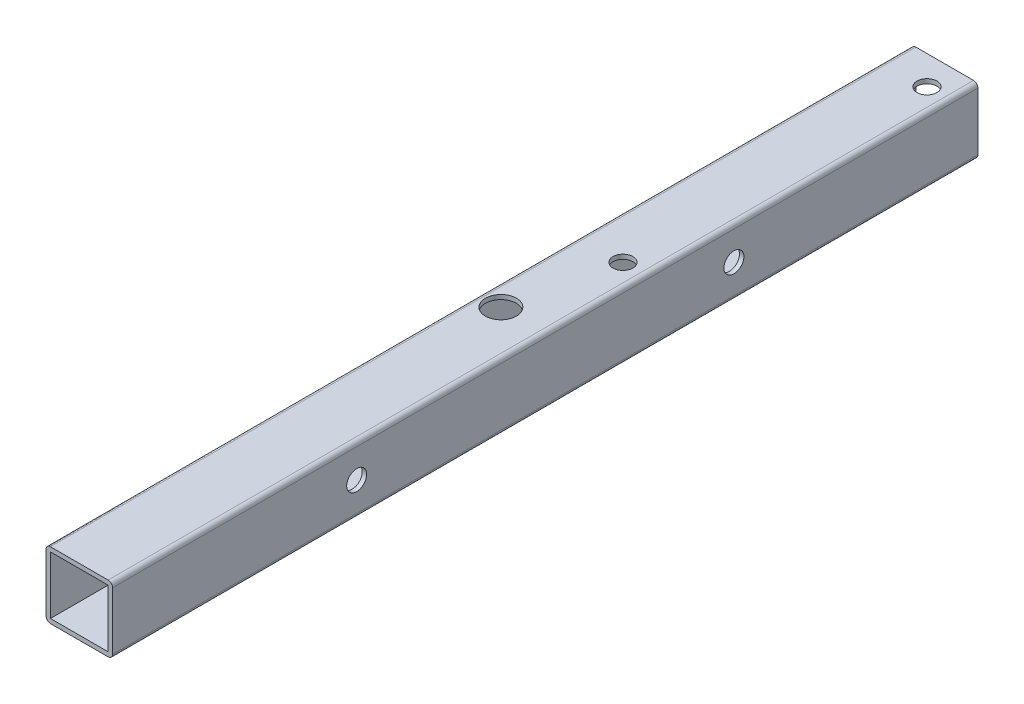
ISO-10303-21;
HEADER;
FILE_DESCRIPTION(('STEP AP214'),'2;1');
FILE_NAME('part.step','',(''),(''),'','','');
FILE_SCHEMA(('AUTOMOTIVE_DESIGN { 1 0 10303 214 1 1 1 1 }'));
ENDSEC;
DATA;
#1=APPLICATION_CONTEXT('core data for automotive mechanical design processes');
#2=APPLICATION_PROTOCOL_DEFINITION('international standard','automotive_design',2000,#1);
#3=PRODUCT_CONTEXT('',#1,'mechanical');
#4=PRODUCT('Part','Part','',(#3));
#5=PRODUCT_RELATED_PRODUCT_CATEGORY('part','',(#4));
#6=PRODUCT_DEFINITION_FORMATION('','',#4);
#7=PRODUCT_DEFINITION_CONTEXT('part definition',#1,'design');
#8=PRODUCT_DEFINITION('design','',#6,#7);
#9=PRODUCT_DEFINITION_SHAPE('','',#8);
#10=(LENGTH_UNIT() NAMED_UNIT(*) SI_UNIT(.MILLI.,.METRE.));
#11=(NAMED_UNIT(*) PLANE_ANGLE_UNIT() SI_UNIT($,.RADIAN.));
#12=(NAMED_UNIT(*) SI_UNIT($,.STERADIAN.) SOLID_ANGLE_UNIT());
#13=UNCERTAINTY_MEASURE_WITH_UNIT(LENGTH_MEASURE(1.E-05),#10,'distance_accuracy_value','');
#14=(GEOMETRIC_REPRESENTATION_CONTEXT(3) GLOBAL_UNCERTAINTY_ASSIGNED_CONTEXT((#13)) GLOBAL_UNIT_ASSIGNED_CONTEXT((#10,
#11,#12)) REPRESENTATION_CONTEXT('',''));
#15=CARTESIAN_POINT('',(0.,0.,0.));
#16=DIRECTION('',(0.,0.,1.));
#17=DIRECTION('',(1.,0.,0.));
#18=AXIS2_PLACEMENT_3D('',#15,#16,#17);
#19=CARTESIAN_POINT('',(-13.,-13.,0.));
#20=DIRECTION('',(0.,0.,-1.));
#21=DIRECTION('',(-1.,0.,0.));
#22=AXIS2_PLACEMENT_3D('',#19,#20,#21);
#23=PLANE('',#22);
#24=CARTESIAN_POINT('',(-13.,-13.,0.));
#25=DIRECTION('',(0.,0.,-1.));
#26=DIRECTION('',(-1.,0.,0.));
#27=AXIS2_PLACEMENT_3D('',#24,#25,#26);
#28=CIRCLE('',#27,2.);
#29=CARTESIAN_POINT('',(-13.,-15.,0.));
#30=VERTEX_POINT('',#29);
#31=CARTESIAN_POINT('',(-15.,-13.,0.));
#32=VERTEX_POINT('',#31);
#33=EDGE_CURVE('E127',#30,#32,#28,.T.);
#34=ORIENTED_EDGE('',*,*,#33,.T.);
#35=DIRECTION('',(0.,-1.,0.));
#36=VECTOR('',#35,1.);
#37=CARTESIAN_POINT('',(-15.,13.,0.));
#38=LINE('',#37,#36);
#39=CARTESIAN_POINT('',(-15.,13.,0.));
#40=VERTEX_POINT('',#39);
#41=EDGE_CURVE('E164',#40,#32,#38,.T.);
#42=ORIENTED_EDGE('',*,*,#41,.F.);
#43=CARTESIAN_POINT('',(-13.,13.,0.));
#44=DIRECTION('',(0.,0.,-1.));
#45=DIRECTION('',(-1.,0.,0.));
#46=AXIS2_PLACEMENT_3D('',#43,#44,#45);
#47=CIRCLE('',#46,2.);
#48=CARTESIAN_POINT('',(-13.,15.,0.));
#49=VERTEX_POINT('',#48);
#50=EDGE_CURVE('E167',#40,#49,#47,.T.);
#51=ORIENTED_EDGE('',*,*,#50,.T.);
#52=DIRECTION('',(1.,0.,0.));
#53=VECTOR('',#52,1.);
#54=CARTESIAN_POINT('',(-13.,15.,0.));
#55=LINE('',#54,#53);
#56=CARTESIAN_POINT('',(13.,15.,0.));
#57=VERTEX_POINT('',#56);
#58=EDGE_CURVE('E170',#49,#57,#55,.T.);
#59=ORIENTED_EDGE('',*,*,#58,.T.);
#60=CARTESIAN_POINT('',(13.,13.,0.));
#61=DIRECTION('',(0.,0.,1.));
#62=DIRECTION('',(1.,0.,0.));
#63=AXIS2_PLACEMENT_3D('',#60,#61,#62);
#64=CIRCLE('',#63,2.);
#65=CARTESIAN_POINT('',(15.,13.,0.));
#66=VERTEX_POINT('',#65);
#67=EDGE_CURVE('E173',#66,#57,#64,.T.);
#68=ORIENTED_EDGE('',*,*,#67,.F.);
#69=DIRECTION('',(0.,1.,0.));
#70=VECTOR('',#69,1.);
#71=CARTESIAN_POINT('',(15.,-13.,0.));
#72=LINE('',#71,#70);
#73=CARTESIAN_POINT('',(15.,-13.,0.));
#74=VERTEX_POINT('',#73);
#75=EDGE_CURVE('E176',#74,#66,#72,.T.);
#76=ORIENTED_EDGE('',*,*,#75,.F.);
#77=CARTESIAN_POINT('',(13.,-13.,0.));
#78=DIRECTION('',(0.,0.,-1.));
#79=DIRECTION('',(-1.,0.,0.));
#80=AXIS2_PLACEMENT_3D('',#77,#78,#79);
#81=CIRCLE('',#80,2.);
#82=CARTESIAN_POINT('',(13.,-15.,0.));
#83=VERTEX_POINT('',#82);
#84=EDGE_CURVE('E178',#74,#83,#81,.T.);
#85=ORIENTED_EDGE('',*,*,#84,.T.);
#86=DIRECTION('',(-1.,0.,0.));
#87=VECTOR('',#86,1.);
#88=CARTESIAN_POINT('',(13.,-15.,0.));
#89=LINE('',#88,#87);
#90=EDGE_CURVE('E181',#83,#30,#89,.T.);
#91=ORIENTED_EDGE('',*,*,#90,.T.);
#92=EDGE_LOOP('',(#34,#42,#51,#59,#68,#76,#85,#91));
#93=FACE_BOUND('',#92,.T.);
#94=DIRECTION('',(1.,0.,0.));
#95=VECTOR('',#94,1.);
#96=CARTESIAN_POINT('',(-13.,13.,0.));
#97=LINE('',#96,#95);
#98=CARTESIAN_POINT('',(-13.,13.,0.));
#99=VERTEX_POINT('',#98);
#100=CARTESIAN_POINT('',(13.,13.,0.));
#101=VERTEX_POINT('',#100);
#102=EDGE_CURVE('E139',#99,#101,#97,.T.);
#103=ORIENTED_EDGE('',*,*,#102,.F.);
#104=DIRECTION('',(0.,-1.,0.));
#105=VECTOR('',#104,1.);
#106=CARTESIAN_POINT('',(-13.,-13.,0.));
#107=LINE('',#106,#105);
#108=CARTESIAN_POINT('',(-13.,-13.,0.));
#109=VERTEX_POINT('',#108);
#110=EDGE_CURVE('E55',#99,#109,#107,.T.);
#111=ORIENTED_EDGE('',*,*,#110,.T.);
#112=DIRECTION('',(-1.,0.,0.));
#113=VECTOR('',#112,1.);
#114=CARTESIAN_POINT('',(-13.,-13.,0.));
#115=LINE('',#114,#113);
#116=CARTESIAN_POINT('',(13.,-13.,0.));
#117=VERTEX_POINT('',#116);
#118=EDGE_CURVE('E131',#117,#109,#115,.T.);
#119=ORIENTED_EDGE('',*,*,#118,.F.);
#120=DIRECTION('',(0.,1.,0.));
#121=VECTOR('',#120,1.);
#122=CARTESIAN_POINT('',(13.,-13.,0.));
#123=LINE('',#122,#121);
#124=EDGE_CURVE('E136',#117,#101,#123,.T.);
#125=ORIENTED_EDGE('',*,*,#124,.T.);
#126=EDGE_LOOP('',(#103,#111,#119,#125));
#127=FACE_BOUND('',#126,.T.);
#128=ADVANCED_FACE('F30',(#93,#127),#23,.T.);
#129=CARTESIAN_POINT('',(-13.,-13.,390.));
#130=DIRECTION('',(0.,0.,-1.));
#131=DIRECTION('',(-1.,0.,0.));
#132=AXIS2_PLACEMENT_3D('',#129,#130,#131);
#133=CYLINDRICAL_SURFACE('',#132,2.);
#134=ORIENTED_EDGE('',*,*,#33,.F.);
#135=DIRECTION('',(0.,0.,-1.));
#136=VECTOR('',#135,1.);
#137=CARTESIAN_POINT('',(-13.,-15.,390.));
#138=LINE('',#137,#136);
#139=CARTESIAN_POINT('',(-13.,-15.,390.));
#140=VERTEX_POINT('',#139);
#141=EDGE_CURVE('E11',#140,#30,#138,.T.);
#142=ORIENTED_EDGE('',*,*,#141,.F.);
#143=CARTESIAN_POINT('',(-13.,-13.,390.));
#144=DIRECTION('',(0.,0.,-1.));
#145=DIRECTION('',(-1.,0.,0.));
#146=AXIS2_PLACEMENT_3D('',#143,#144,#145);
#147=CIRCLE('',#146,2.);
#148=CARTESIAN_POINT('',(-15.,-13.,390.));
#149=VERTEX_POINT('',#148);
#150=EDGE_CURVE('E184',#140,#149,#147,.T.);
#151=ORIENTED_EDGE('',*,*,#150,.T.);
#152=DIRECTION('',(0.,0.,-1.));
#153=VECTOR('',#152,1.);
#154=CARTESIAN_POINT('',(-15.,-13.,390.));
#155=LINE('',#154,#153);
#156=EDGE_CURVE('E204',#149,#32,#155,.T.);
#157=ORIENTED_EDGE('',*,*,#156,.T.);
#158=EDGE_LOOP('',(#134,#142,#151,#157));
#159=FACE_BOUND('',#158,.T.);
#160=ADVANCED_FACE('F32',(#159),#133,.T.);
#161=CARTESIAN_POINT('',(13.,-15.,390.));
#162=DIRECTION('',(0.,-1.,0.));
#163=DIRECTION('',(1.,0.,0.));
#164=AXIS2_PLACEMENT_3D('',#161,#162,#163);
#165=PLANE('',#164);
#166=CARTESIAN_POINT('',(5.,-15.,13.));
#167=DIRECTION('',(0.,-1.,0.));
#168=DIRECTION('',(1.,0.,0.));
#169=AXIS2_PLACEMENT_3D('',#166,#167,#168);
#170=CIRCLE('',#169,7.);
#171=CARTESIAN_POINT('',(12.,-15.,13.));
#172=VERTEX_POINT('',#171);
#173=EDGE_CURVE('E497',#172,#172,#170,.T.);
#174=ORIENTED_EDGE('',*,*,#173,.F.);
#175=EDGE_LOOP('',(#174));
#176=FACE_BOUND('',#175,.T.);
#177=CARTESIAN_POINT('',(5.00000000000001,-15.,150.));
#178=DIRECTION('',(0.,-1.,0.));
#179=DIRECTION('',(1.,0.,0.));
#180=AXIS2_PLACEMENT_3D('',#177,#178,#179);
#181=CIRCLE('',#180,7.);
#182=CARTESIAN_POINT('',(12.,-15.,150.));
#183=VERTEX_POINT('',#182);
#184=EDGE_CURVE('E500',#183,#183,#181,.T.);
#185=ORIENTED_EDGE('',*,*,#184,.F.);
#186=EDGE_LOOP('',(#185));
#187=FACE_BOUND('',#186,.T.);
#188=CARTESIAN_POINT('',(-5.,-15.,195.));
#189=DIRECTION('',(0.,1.,0.));
#190=DIRECTION('',(0.,0.,1.));
#191=AXIS2_PLACEMENT_3D('',#188,#189,#190);
#192=CIRCLE('',#191,7.);
#193=CARTESIAN_POINT('',(-5.,-15.,202.));
#194=VERTEX_POINT('',#193);
#195=EDGE_CURVE('E227',#194,#194,#192,.T.);
#196=ORIENTED_EDGE('',*,*,#195,.T.);
#197=EDGE_LOOP('',(#196));
#198=FACE_BOUND('',#197,.T.);
#199=ORIENTED_EDGE('',*,*,#90,.F.);
#200=DIRECTION('',(0.,0.,-1.));
#201=VECTOR('',#200,1.);
#202=CARTESIAN_POINT('',(13.,-15.,390.));
#203=LINE('',#202,#201);
#204=CARTESIAN_POINT('',(13.,-15.,390.));
#205=VERTEX_POINT('',#204);
#206=EDGE_CURVE('E39',#205,#83,#203,.T.);
#207=ORIENTED_EDGE('',*,*,#206,.F.);
#208=DIRECTION('',(-1.,0.,0.));
#209=VECTOR('',#208,1.);
#210=CARTESIAN_POINT('',(13.,-15.,390.));
#211=LINE('',#210,#209);
#212=EDGE_CURVE('E202',#205,#140,#211,.T.);
#213=ORIENTED_EDGE('',*,*,#212,.T.);
#214=ORIENTED_EDGE('',*,*,#141,.T.);
#215=EDGE_LOOP('',(#199,#207,#213,#214));
#216=FACE_BOUND('',#215,.T.);
#217=ADVANCED_FACE('F306',(#176,#187,#198,#216),#165,.T.);
#218=CARTESIAN_POINT('',(13.,-13.,390.));
#219=DIRECTION('',(0.,0.,-1.));
#220=DIRECTION('',(-1.,0.,0.));
#221=AXIS2_PLACEMENT_3D('',#218,#219,#220);
#222=CYLINDRICAL_SURFACE('',#221,2.);
#223=ORIENTED_EDGE('',*,*,#84,.F.);
#224=DIRECTION('',(0.,0.,-1.));
#225=VECTOR('',#224,1.);
#226=CARTESIAN_POINT('',(15.,-13.,390.));
#227=LINE('',#226,#225);
#228=CARTESIAN_POINT('',(15.,-13.,390.));
#229=VERTEX_POINT('',#228);
#230=EDGE_CURVE('E207',#229,#74,#227,.T.);
#231=ORIENTED_EDGE('',*,*,#230,.F.);
#232=CARTESIAN_POINT('',(13.,-13.,390.));
#233=DIRECTION('',(0.,0.,-1.));
#234=DIRECTION('',(-1.,0.,0.));
#235=AXIS2_PLACEMENT_3D('',#232,#233,#234);
#236=CIRCLE('',#235,2.);
#237=EDGE_CURVE('E199',#229,#205,#236,.T.);
#238=ORIENTED_EDGE('',*,*,#237,.T.);
#239=ORIENTED_EDGE('',*,*,#206,.T.);
#240=EDGE_LOOP('',(#223,#231,#238,#239));
#241=FACE_BOUND('',#240,.T.);
#242=ADVANCED_FACE('F303',(#241),#222,.T.);
#243=CARTESIAN_POINT('',(15.,-13.,390.));
#244=DIRECTION('',(-1.,0.,0.));
#245=DIRECTION('',(0.,0.,1.));
#246=AXIS2_PLACEMENT_3D('',#243,#244,#245);
#247=PLANE('',#246);
#248=CARTESIAN_POINT('',(15.,0.,280.));
#249=DIRECTION('',(-1.,0.,0.));
#250=DIRECTION('',(0.,-1.,0.));
#251=AXIS2_PLACEMENT_3D('',#248,#249,#250);
#252=CIRCLE('',#251,4.50000000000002);
#253=CARTESIAN_POINT('',(15.,-4.50000000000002,280.));
#254=VERTEX_POINT('',#253);
#255=EDGE_CURVE('E235',#254,#254,#252,.T.);
#256=ORIENTED_EDGE('',*,*,#255,.T.);
#257=EDGE_LOOP('',(#256));
#258=FACE_BOUND('',#257,.T.);
#259=CARTESIAN_POINT('',(15.,0.,110.));
#260=DIRECTION('',(-1.,0.,0.));
#261=DIRECTION('',(0.,-1.,0.));
#262=AXIS2_PLACEMENT_3D('',#259,#260,#261);
#263=CIRCLE('',#262,4.5);
#264=CARTESIAN_POINT('',(15.,-4.5,110.));
#265=VERTEX_POINT('',#264);
#266=EDGE_CURVE('E231',#265,#265,#263,.T.);
#267=ORIENTED_EDGE('',*,*,#266,.T.);
#268=EDGE_LOOP('',(#267));
#269=FACE_BOUND('',#268,.T.);
#270=ORIENTED_EDGE('',*,*,#75,.T.);
#271=DIRECTION('',(0.,0.,-1.));
#272=VECTOR('',#271,1.);
#273=CARTESIAN_POINT('',(15.,13.,390.));
#274=LINE('',#273,#272);
#275=CARTESIAN_POINT('',(15.,13.,390.));
#276=VERTEX_POINT('',#275);
#277=EDGE_CURVE('E209',#276,#66,#274,.T.);
#278=ORIENTED_EDGE('',*,*,#277,.F.);
#279=DIRECTION('',(0.,1.,0.));
#280=VECTOR('',#279,1.);
#281=CARTESIAN_POINT('',(15.,-13.,390.));
#282=LINE('',#281,#280);
#283=EDGE_CURVE('E197',#229,#276,#282,.T.);
#284=ORIENTED_EDGE('',*,*,#283,.F.);
#285=ORIENTED_EDGE('',*,*,#230,.T.);
#286=EDGE_LOOP('',(#270,#278,#284,#285));
#287=FACE_BOUND('',#286,.T.);
#288=ADVANCED_FACE('F335',(#258,#269,#287),#247,.F.);
#289=CARTESIAN_POINT('',(13.,13.,390.));
#290=DIRECTION('',(0.,0.,-1.));
#291=DIRECTION('',(-1.,0.,0.));
#292=AXIS2_PLACEMENT_3D('',#289,#290,#291);
#293=CYLINDRICAL_SURFACE('',#292,2.);
#294=ORIENTED_EDGE('',*,*,#67,.T.);
#295=DIRECTION('',(0.,0.,-1.));
#296=VECTOR('',#295,1.);
#297=CARTESIAN_POINT('',(13.,15.,390.));
#298=LINE('',#297,#296);
#299=CARTESIAN_POINT('',(13.,15.,390.));
#300=VERTEX_POINT('',#299);
#301=EDGE_CURVE('E212',#300,#57,#298,.T.);
#302=ORIENTED_EDGE('',*,*,#301,.F.);
#303=CARTESIAN_POINT('',(13.,13.,390.));
#304=DIRECTION('',(0.,0.,1.));
#305=DIRECTION('',(1.,0.,0.));
#306=AXIS2_PLACEMENT_3D('',#303,#304,#305);
#307=CIRCLE('',#306,2.);
#308=EDGE_CURVE('E195',#276,#300,#307,.T.);
#309=ORIENTED_EDGE('',*,*,#308,.F.);
#310=ORIENTED_EDGE('',*,*,#277,.T.);
#311=EDGE_LOOP('',(#294,#302,#309,#310));
#312=FACE_BOUND('',#311,.T.);
#313=ADVANCED_FACE('F273',(#312),#293,.T.);
#314=CARTESIAN_POINT('',(-13.,15.,390.));
#315=DIRECTION('',(0.,1.,0.));
#316=DIRECTION('',(-1.,0.,0.));
#317=AXIS2_PLACEMENT_3D('',#314,#315,#316);
#318=PLANE('',#317);
#319=CARTESIAN_POINT('',(-5.,15.,195.));
#320=DIRECTION('',(0.,1.,0.));
#321=DIRECTION('',(0.,0.,1.));
#322=AXIS2_PLACEMENT_3D('',#319,#320,#321);
#323=CIRCLE('',#322,7.);
#324=CARTESIAN_POINT('',(-5.,15.,202.));
#325=VERTEX_POINT('',#324);
#326=EDGE_CURVE('E257',#325,#325,#323,.T.);
#327=ORIENTED_EDGE('',*,*,#326,.F.);
#328=EDGE_LOOP('',(#327));
#329=FACE_BOUND('',#328,.T.);
#330=CARTESIAN_POINT('',(5.00000000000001,15.,150.));
#331=DIRECTION('',(0.,1.,0.));
#332=DIRECTION('',(0.,0.,1.));
#333=AXIS2_PLACEMENT_3D('',#330,#331,#332);
#334=CIRCLE('',#333,4.5);
#335=CARTESIAN_POINT('',(5.00000000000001,15.,154.5));
#336=VERTEX_POINT('',#335);
#337=EDGE_CURVE('E222',#336,#336,#334,.T.);
#338=ORIENTED_EDGE('',*,*,#337,.F.);
#339=EDGE_LOOP('',(#338));
#340=FACE_BOUND('',#339,.T.);
#341=CARTESIAN_POINT('',(5.00000000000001,15.,13.));
#342=DIRECTION('',(0.,1.,0.));
#343=DIRECTION('',(0.,0.,1.));
#344=AXIS2_PLACEMENT_3D('',#341,#342,#343);
#345=CIRCLE('',#344,4.5);
#346=CARTESIAN_POINT('',(5.00000000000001,15.,17.5));
#347=VERTEX_POINT('',#346);
#348=EDGE_CURVE('E143',#347,#347,#345,.T.);
#349=ORIENTED_EDGE('',*,*,#348,.F.);
#350=EDGE_LOOP('',(#349));
#351=FACE_BOUND('',#350,.T.);
#352=ORIENTED_EDGE('',*,*,#58,.F.);
#353=DIRECTION('',(0.,0.,-1.));
#354=VECTOR('',#353,1.);
#355=CARTESIAN_POINT('',(-13.,15.,390.));
#356=LINE('',#355,#354);
#357=CARTESIAN_POINT('',(-13.,15.,390.));
#358=VERTEX_POINT('',#357);
#359=EDGE_CURVE('E214',#358,#49,#356,.T.);
#360=ORIENTED_EDGE('',*,*,#359,.F.);
#361=DIRECTION('',(1.,0.,0.));
#362=VECTOR('',#361,1.);
#363=CARTESIAN_POINT('',(-13.,15.,390.));
#364=LINE('',#363,#362);
#365=EDGE_CURVE('E192',#358,#300,#364,.T.);
#366=ORIENTED_EDGE('',*,*,#365,.T.);
#367=ORIENTED_EDGE('',*,*,#301,.T.);
#368=EDGE_LOOP('',(#352,#360,#366,#367));
#369=FACE_BOUND('',#368,.T.);
#370=ADVANCED_FACE('F269',(#329,#340,#351,#369),#318,.T.);
#371=CARTESIAN_POINT('',(-13.,13.,390.));
#372=DIRECTION('',(0.,0.,-1.));
#373=DIRECTION('',(-1.,0.,0.));
#374=AXIS2_PLACEMENT_3D('',#371,#372,#373);
#375=CYLINDRICAL_SURFACE('',#374,2.);
#376=ORIENTED_EDGE('',*,*,#50,.F.);
#377=DIRECTION('',(0.,0.,-1.));
#378=VECTOR('',#377,1.);
#379=CARTESIAN_POINT('',(-15.,13.,390.));
#380=LINE('',#379,#378);
#381=CARTESIAN_POINT('',(-15.,13.,390.));
#382=VERTEX_POINT('',#381);
#383=EDGE_CURVE('E216',#382,#40,#380,.T.);
#384=ORIENTED_EDGE('',*,*,#383,.F.);
#385=CARTESIAN_POINT('',(-13.,13.,390.));
#386=DIRECTION('',(0.,0.,-1.));
#387=DIRECTION('',(-1.,0.,0.));
#388=AXIS2_PLACEMENT_3D('',#385,#386,#387);
#389=CIRCLE('',#388,2.);
#390=EDGE_CURVE('E189',#382,#358,#389,.T.);
#391=ORIENTED_EDGE('',*,*,#390,.T.);
#392=ORIENTED_EDGE('',*,*,#359,.T.);
#393=EDGE_LOOP('',(#376,#384,#391,#392));
#394=FACE_BOUND('',#393,.T.);
#395=ADVANCED_FACE('F272',(#394),#375,.T.);
#396=CARTESIAN_POINT('',(-15.,13.,390.));
#397=DIRECTION('',(1.,0.,0.));
#398=DIRECTION('',(0.,1.,0.));
#399=AXIS2_PLACEMENT_3D('',#396,#397,#398);
#400=PLANE('',#399);
#401=CARTESIAN_POINT('',(-15.,0.,280.));
#402=DIRECTION('',(-1.,0.,0.));
#403=DIRECTION('',(0.,-1.,0.));
#404=AXIS2_PLACEMENT_3D('',#401,#402,#403);
#405=CIRCLE('',#404,4.50000000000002);
#406=CARTESIAN_POINT('',(-15.,-4.50000000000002,280.));
#407=VERTEX_POINT('',#406);
#408=EDGE_CURVE('E242',#407,#407,#405,.T.);
#409=ORIENTED_EDGE('',*,*,#408,.F.);
#410=EDGE_LOOP('',(#409));
#411=FACE_BOUND('',#410,.T.);
#412=CARTESIAN_POINT('',(-15.,0.,110.));
#413=DIRECTION('',(-1.,0.,0.));
#414=DIRECTION('',(0.,-1.,0.));
#415=AXIS2_PLACEMENT_3D('',#412,#413,#414);
#416=CIRCLE('',#415,4.5);
#417=CARTESIAN_POINT('',(-15.,-4.50000000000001,110.));
#418=VERTEX_POINT('',#417);
#419=EDGE_CURVE('E239',#418,#418,#416,.T.);
#420=ORIENTED_EDGE('',*,*,#419,.F.);
#421=EDGE_LOOP('',(#420));
#422=FACE_BOUND('',#421,.T.);
#423=ORIENTED_EDGE('',*,*,#41,.T.);
#424=ORIENTED_EDGE('',*,*,#156,.F.);
#425=DIRECTION('',(0.,-1.,0.));
#426=VECTOR('',#425,1.);
#427=CARTESIAN_POINT('',(-15.,13.,390.));
#428=LINE('',#427,#426);
#429=EDGE_CURVE('E187',#382,#149,#428,.T.);
#430=ORIENTED_EDGE('',*,*,#429,.F.);
#431=ORIENTED_EDGE('',*,*,#383,.T.);
#432=EDGE_LOOP('',(#423,#424,#430,#431));
#433=FACE_BOUND('',#432,.T.);
#434=ADVANCED_FACE('F310',(#411,#422,#433),#400,.F.);
#435=CARTESIAN_POINT('',(-13.,-13.,390.));
#436=DIRECTION('',(0.,0.,-1.));
#437=DIRECTION('',(-1.,0.,0.));
#438=AXIS2_PLACEMENT_3D('',#435,#436,#437);
#439=PLANE('',#438);
#440=DIRECTION('',(0.,1.,0.));
#441=VECTOR('',#440,1.);
#442=CARTESIAN_POINT('',(13.,-13.,390.));
#443=LINE('',#442,#441);
#444=CARTESIAN_POINT('',(13.,-13.,390.));
#445=VERTEX_POINT('',#444);
#446=CARTESIAN_POINT('',(13.,13.,390.));
#447=VERTEX_POINT('',#446);
#448=EDGE_CURVE('E153',#445,#447,#443,.T.);
#449=ORIENTED_EDGE('',*,*,#448,.F.);
#450=DIRECTION('',(-1.,0.,0.));
#451=VECTOR('',#450,1.);
#452=CARTESIAN_POINT('',(-13.,-13.,390.));
#453=LINE('',#452,#451);
#454=CARTESIAN_POINT('',(-13.,-13.,390.));
#455=VERTEX_POINT('',#454);
#456=EDGE_CURVE('E151',#445,#455,#453,.T.);
#457=ORIENTED_EDGE('',*,*,#456,.T.);
#458=DIRECTION('',(0.,-1.,0.));
#459=VECTOR('',#458,1.);
#460=CARTESIAN_POINT('',(-13.,-13.,390.));
#461=LINE('',#460,#459);
#462=CARTESIAN_POINT('',(-13.,13.,390.));
#463=VERTEX_POINT('',#462);
#464=EDGE_CURVE('E123',#463,#455,#461,.T.);
#465=ORIENTED_EDGE('',*,*,#464,.F.);
#466=DIRECTION('',(1.,0.,0.));
#467=VECTOR('',#466,1.);
#468=CARTESIAN_POINT('',(-13.,13.,390.));
#469=LINE('',#468,#467);
#470=EDGE_CURVE('E155',#463,#447,#469,.T.);
#471=ORIENTED_EDGE('',*,*,#470,.T.);
#472=EDGE_LOOP('',(#449,#457,#465,#471));
#473=FACE_BOUND('',#472,.T.);
#474=ORIENTED_EDGE('',*,*,#150,.F.);
#475=ORIENTED_EDGE('',*,*,#212,.F.);
#476=ORIENTED_EDGE('',*,*,#237,.F.);
#477=ORIENTED_EDGE('',*,*,#283,.T.);
#478=ORIENTED_EDGE('',*,*,#308,.T.);
#479=ORIENTED_EDGE('',*,*,#365,.F.);
#480=ORIENTED_EDGE('',*,*,#390,.F.);
#481=ORIENTED_EDGE('',*,*,#429,.T.);
#482=EDGE_LOOP('',(#474,#475,#476,#477,#478,#479,#480,#481));
#483=FACE_BOUND('',#482,.T.);
#484=ADVANCED_FACE('F291',(#473,#483),#439,.F.);
#485=CARTESIAN_POINT('',(-13.,-13.,390.));
#486=DIRECTION('',(1.,0.,0.));
#487=DIRECTION('',(0.,1.,0.));
#488=AXIS2_PLACEMENT_3D('',#485,#486,#487);
#489=PLANE('',#488);
#490=CARTESIAN_POINT('',(-13.,0.,280.));
#491=DIRECTION('',(1.,0.,0.));
#492=DIRECTION('',(0.,1.,0.));
#493=AXIS2_PLACEMENT_3D('',#490,#491,#492);
#494=CIRCLE('',#493,4.50000000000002);
#495=CARTESIAN_POINT('',(-13.,-4.50000000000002,280.));
#496=VERTEX_POINT('',#495);
#497=EDGE_CURVE('E234',#496,#496,#494,.T.);
#498=ORIENTED_EDGE('',*,*,#497,.F.);
#499=EDGE_LOOP('',(#498));
#500=FACE_BOUND('',#499,.T.);
#501=CARTESIAN_POINT('',(-13.,0.,110.));
#502=DIRECTION('',(1.,0.,0.));
#503=DIRECTION('',(0.,1.,0.));
#504=AXIS2_PLACEMENT_3D('',#501,#502,#503);
#505=CIRCLE('',#504,4.5);
#506=CARTESIAN_POINT('',(-13.,-4.50000000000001,110.));
#507=VERTEX_POINT('',#506);
#508=EDGE_CURVE('E230',#507,#507,#505,.T.);
#509=ORIENTED_EDGE('',*,*,#508,.F.);
#510=EDGE_LOOP('',(#509));
#511=FACE_BOUND('',#510,.T.);
#512=ORIENTED_EDGE('',*,*,#110,.F.);
#513=DIRECTION('',(0.,0.,-1.));
#514=VECTOR('',#513,1.);
#515=CARTESIAN_POINT('',(-13.,13.,390.));
#516=LINE('',#515,#514);
#517=EDGE_CURVE('E158',#463,#99,#516,.T.);
#518=ORIENTED_EDGE('',*,*,#517,.F.);
#519=ORIENTED_EDGE('',*,*,#464,.T.);
#520=DIRECTION('',(0.,0.,-1.));
#521=VECTOR('',#520,1.);
#522=CARTESIAN_POINT('',(-13.,-13.,390.));
#523=LINE('',#522,#521);
#524=EDGE_CURVE('E119',#455,#109,#523,.T.);
#525=ORIENTED_EDGE('',*,*,#524,.T.);
#526=EDGE_LOOP('',(#512,#518,#519,#525));
#527=FACE_BOUND('',#526,.T.);
#528=ADVANCED_FACE('F121',(#500,#511,#527),#489,.T.);
#529=CARTESIAN_POINT('',(-13.,-13.,390.));
#530=DIRECTION('',(0.,-1.,0.));
#531=DIRECTION('',(1.,0.,0.));
#532=AXIS2_PLACEMENT_3D('',#529,#530,#531);
#533=PLANE('',#532);
#534=CARTESIAN_POINT('',(5.,-13.,13.));
#535=DIRECTION('',(0.,-1.,0.));
#536=DIRECTION('',(1.,0.,0.));
#537=AXIS2_PLACEMENT_3D('',#534,#535,#536);
#538=CIRCLE('',#537,7.);
#539=CARTESIAN_POINT('',(12.,-13.,13.));
#540=VERTEX_POINT('',#539);
#541=EDGE_CURVE('E34',#540,#540,#538,.T.);
#542=ORIENTED_EDGE('',*,*,#541,.T.);
#543=EDGE_LOOP('',(#542));
#544=FACE_BOUND('',#543,.T.);
#545=CARTESIAN_POINT('',(5.,-13.,150.));
#546=DIRECTION('',(0.,-1.,0.));
#547=DIRECTION('',(1.,0.,0.));
#548=AXIS2_PLACEMENT_3D('',#545,#546,#547);
#549=CIRCLE('',#548,7.);
#550=CARTESIAN_POINT('',(12.,-13.,150.));
#551=VERTEX_POINT('',#550);
#552=EDGE_CURVE('E247',#551,#551,#549,.T.);
#553=ORIENTED_EDGE('',*,*,#552,.T.);
#554=EDGE_LOOP('',(#553));
#555=FACE_BOUND('',#554,.T.);
#556=CARTESIAN_POINT('',(-5.,-13.,195.));
#557=DIRECTION('',(0.,-1.,0.));
#558=DIRECTION('',(1.,0.,0.));
#559=AXIS2_PLACEMENT_3D('',#556,#557,#558);
#560=CIRCLE('',#559,7.);
#561=CARTESIAN_POINT('',(2.,-13.,195.));
#562=VERTEX_POINT('',#561);
#563=EDGE_CURVE('E226',#562,#562,#560,.T.);
#564=ORIENTED_EDGE('',*,*,#563,.T.);
#565=EDGE_LOOP('',(#564));
#566=FACE_BOUND('',#565,.T.);
#567=ORIENTED_EDGE('',*,*,#118,.T.);
#568=ORIENTED_EDGE('',*,*,#524,.F.);
#569=ORIENTED_EDGE('',*,*,#456,.F.);
#570=DIRECTION('',(0.,0.,-1.));
#571=VECTOR('',#570,1.);
#572=CARTESIAN_POINT('',(13.,-13.,390.));
#573=LINE('',#572,#571);
#574=EDGE_CURVE('E128',#445,#117,#573,.T.);
#575=ORIENTED_EDGE('',*,*,#574,.T.);
#576=EDGE_LOOP('',(#567,#568,#569,#575));
#577=FACE_BOUND('',#576,.T.);
#578=ADVANCED_FACE('F132',(#544,#555,#566,#577),#533,.F.);
#579=CARTESIAN_POINT('',(13.,-13.,390.));
#580=DIRECTION('',(-1.,0.,0.));
#581=DIRECTION('',(0.,0.,1.));
#582=AXIS2_PLACEMENT_3D('',#579,#580,#581);
#583=PLANE('',#582);
#584=CARTESIAN_POINT('',(13.,0.,280.));
#585=DIRECTION('',(-1.,0.,0.));
#586=DIRECTION('',(0.,0.,1.));
#587=AXIS2_PLACEMENT_3D('',#584,#585,#586);
#588=CIRCLE('',#587,4.50000000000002);
#589=CARTESIAN_POINT('',(13.,-4.50000000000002,280.));
#590=VERTEX_POINT('',#589);
#591=EDGE_CURVE('E232',#590,#590,#588,.T.);
#592=ORIENTED_EDGE('',*,*,#591,.F.);
#593=EDGE_LOOP('',(#592));
#594=FACE_BOUND('',#593,.T.);
#595=CARTESIAN_POINT('',(13.,0.,110.));
#596=DIRECTION('',(-1.,0.,0.));
#597=DIRECTION('',(0.,0.,1.));
#598=AXIS2_PLACEMENT_3D('',#595,#596,#597);
#599=CIRCLE('',#598,4.5);
#600=CARTESIAN_POINT('',(13.,-4.5,110.));
#601=VERTEX_POINT('',#600);
#602=EDGE_CURVE('E228',#601,#601,#599,.T.);
#603=ORIENTED_EDGE('',*,*,#602,.F.);
#604=EDGE_LOOP('',(#603));
#605=FACE_BOUND('',#604,.T.);
#606=ORIENTED_EDGE('',*,*,#124,.F.);
#607=ORIENTED_EDGE('',*,*,#574,.F.);
#608=ORIENTED_EDGE('',*,*,#448,.T.);
#609=DIRECTION('',(0.,0.,-1.));
#610=VECTOR('',#609,1.);
#611=CARTESIAN_POINT('',(13.,13.,390.));
#612=LINE('',#611,#610);
#613=EDGE_CURVE('E47',#447,#101,#612,.T.);
#614=ORIENTED_EDGE('',*,*,#613,.T.);
#615=EDGE_LOOP('',(#606,#607,#608,#614));
#616=FACE_BOUND('',#615,.T.);
#617=ADVANCED_FACE('F375',(#594,#605,#616),#583,.T.);
#618=CARTESIAN_POINT('',(-13.,13.,390.));
#619=DIRECTION('',(0.,1.,0.));
#620=DIRECTION('',(-1.,0.,0.));
#621=AXIS2_PLACEMENT_3D('',#618,#619,#620);
#622=PLANE('',#621);
#623=CARTESIAN_POINT('',(-5.,13.,195.));
#624=DIRECTION('',(0.,1.,0.));
#625=DIRECTION('',(-1.,0.,0.));
#626=AXIS2_PLACEMENT_3D('',#623,#624,#625);
#627=CIRCLE('',#626,7.);
#628=CARTESIAN_POINT('',(-12.,13.,195.));
#629=VERTEX_POINT('',#628);
#630=EDGE_CURVE('E223',#629,#629,#627,.T.);
#631=ORIENTED_EDGE('',*,*,#630,.T.);
#632=EDGE_LOOP('',(#631));
#633=FACE_BOUND('',#632,.T.);
#634=CARTESIAN_POINT('',(5.00000000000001,13.,150.));
#635=DIRECTION('',(0.,1.,0.));
#636=DIRECTION('',(-1.,0.,0.));
#637=AXIS2_PLACEMENT_3D('',#634,#635,#636);
#638=CIRCLE('',#637,4.5);
#639=CARTESIAN_POINT('',(0.500000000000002,13.,150.));
#640=VERTEX_POINT('',#639);
#641=EDGE_CURVE('E219',#640,#640,#638,.T.);
#642=ORIENTED_EDGE('',*,*,#641,.T.);
#643=EDGE_LOOP('',(#642));
#644=FACE_BOUND('',#643,.T.);
#645=CARTESIAN_POINT('',(5.00000000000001,13.,13.));
#646=DIRECTION('',(0.,1.,0.));
#647=DIRECTION('',(-1.,0.,0.));
#648=AXIS2_PLACEMENT_3D('',#645,#646,#647);
#649=CIRCLE('',#648,4.5);
#650=CARTESIAN_POINT('',(0.500000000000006,13.,13.));
#651=VERTEX_POINT('',#650);
#652=EDGE_CURVE('E140',#651,#651,#649,.T.);
#653=ORIENTED_EDGE('',*,*,#652,.T.);
#654=EDGE_LOOP('',(#653));
#655=FACE_BOUND('',#654,.T.);
#656=ORIENTED_EDGE('',*,*,#102,.T.);
#657=ORIENTED_EDGE('',*,*,#613,.F.);
#658=ORIENTED_EDGE('',*,*,#470,.F.);
#659=ORIENTED_EDGE('',*,*,#517,.T.);
#660=EDGE_LOOP('',(#656,#657,#658,#659));
#661=FACE_BOUND('',#660,.T.);
#662=ADVANCED_FACE('F383',(#633,#644,#655,#661),#622,.F.);
#663=CARTESIAN_POINT('',(5.00000000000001,-15.,13.));
#664=DIRECTION('',(0.,1.,0.));
#665=DIRECTION('',(0.,0.,1.));
#666=AXIS2_PLACEMENT_3D('',#663,#664,#665);
#667=CYLINDRICAL_SURFACE('',#666,4.5);
#668=ORIENTED_EDGE('',*,*,#348,.T.);
#669=EDGE_LOOP('',(#668));
#670=FACE_BOUND('',#669,.T.);
#671=ORIENTED_EDGE('',*,*,#652,.F.);
#672=EDGE_LOOP('',(#671));
#673=FACE_BOUND('',#672,.T.);
#674=ADVANCED_FACE('F391',(#670,#673),#667,.F.);
#675=CARTESIAN_POINT('',(5.00000000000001,-15.,150.));
#676=DIRECTION('',(0.,1.,0.));
#677=DIRECTION('',(0.,0.,1.));
#678=AXIS2_PLACEMENT_3D('',#675,#676,#677);
#679=CYLINDRICAL_SURFACE('',#678,4.5);
#680=ORIENTED_EDGE('',*,*,#337,.T.);
#681=EDGE_LOOP('',(#680));
#682=FACE_BOUND('',#681,.T.);
#683=ORIENTED_EDGE('',*,*,#641,.F.);
#684=EDGE_LOOP('',(#683));
#685=FACE_BOUND('',#684,.T.);
#686=ADVANCED_FACE('F266',(#682,#685),#679,.F.);
#687=CARTESIAN_POINT('',(-5.,-15.,195.));
#688=DIRECTION('',(0.,1.,0.));
#689=DIRECTION('',(0.,0.,1.));
#690=AXIS2_PLACEMENT_3D('',#687,#688,#689);
#691=CYLINDRICAL_SURFACE('',#690,7.);
#692=ORIENTED_EDGE('',*,*,#326,.T.);
#693=EDGE_LOOP('',(#692));
#694=FACE_BOUND('',#693,.T.);
#695=ORIENTED_EDGE('',*,*,#630,.F.);
#696=EDGE_LOOP('',(#695));
#697=FACE_BOUND('',#696,.T.);
#698=ADVANCED_FACE('F406',(#694,#697),#691,.F.);
#699=ORIENTED_EDGE('',*,*,#195,.F.);
#700=EDGE_LOOP('',(#699));
#701=FACE_BOUND('',#700,.T.);
#702=ORIENTED_EDGE('',*,*,#563,.F.);
#703=EDGE_LOOP('',(#702));
#704=FACE_BOUND('',#703,.T.);
#705=ADVANCED_FACE('F413',(#701,#704),#691,.F.);
#706=CARTESIAN_POINT('',(15.,0.,110.));
#707=DIRECTION('',(-1.,0.,0.));
#708=DIRECTION('',(0.,-1.,0.));
#709=AXIS2_PLACEMENT_3D('',#706,#707,#708);
#710=CYLINDRICAL_SURFACE('',#709,4.5);
#711=CARTESIAN_POINT('',(13.,-4.5,110.));
#712=CARTESIAN_POINT('',(13.0208333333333,-4.5,110.));
#713=CARTESIAN_POINT('',(13.0416666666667,-4.5,110.));
#714=CARTESIAN_POINT('',(13.0833333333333,-4.5,110.));
#715=CARTESIAN_POINT('',(13.1041666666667,-4.5,110.));
#716=CARTESIAN_POINT('',(13.1458333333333,-4.5,110.));
#717=CARTESIAN_POINT('',(13.1666666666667,-4.5,110.));
#718=CARTESIAN_POINT('',(13.2083333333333,-4.5,110.));
#719=CARTESIAN_POINT('',(13.2291666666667,-4.5,110.));
#720=CARTESIAN_POINT('',(13.2708333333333,-4.5,110.));
#721=CARTESIAN_POINT('',(13.2916666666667,-4.5,110.));
#722=CARTESIAN_POINT('',(13.3333333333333,-4.5,110.));
#723=CARTESIAN_POINT('',(13.3541666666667,-4.5,110.));
#724=CARTESIAN_POINT('',(13.3958333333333,-4.5,110.));
#725=CARTESIAN_POINT('',(13.4166666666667,-4.5,110.));
#726=CARTESIAN_POINT('',(13.4583333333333,-4.5,110.));
#727=CARTESIAN_POINT('',(13.4791666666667,-4.5,110.));
#728=CARTESIAN_POINT('',(13.5208333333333,-4.5,110.));
#729=CARTESIAN_POINT('',(13.5416666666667,-4.5,110.));
#730=CARTESIAN_POINT('',(13.5833333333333,-4.5,110.));
#731=CARTESIAN_POINT('',(13.6041666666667,-4.5,110.));
#732=CARTESIAN_POINT('',(13.6458333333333,-4.5,110.));
#733=CARTESIAN_POINT('',(13.6666666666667,-4.5,110.));
#734=CARTESIAN_POINT('',(13.7083333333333,-4.5,110.));
#735=CARTESIAN_POINT('',(13.7291666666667,-4.5,110.));
#736=CARTESIAN_POINT('',(13.7708333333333,-4.5,110.));
#737=CARTESIAN_POINT('',(13.7916666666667,-4.5,110.));
#738=CARTESIAN_POINT('',(13.8333333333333,-4.5,110.));
#739=CARTESIAN_POINT('',(13.8541666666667,-4.5,110.));
#740=CARTESIAN_POINT('',(13.8958333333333,-4.5,110.));
#741=CARTESIAN_POINT('',(13.9166666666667,-4.5,110.));
#742=CARTESIAN_POINT('',(13.9583333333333,-4.5,110.));
#743=CARTESIAN_POINT('',(13.9791666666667,-4.5,110.));
#744=CARTESIAN_POINT('',(14.0208333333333,-4.5,110.));
#745=CARTESIAN_POINT('',(14.0416666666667,-4.5,110.));
#746=CARTESIAN_POINT('',(14.0833333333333,-4.5,110.));
#747=CARTESIAN_POINT('',(14.1041666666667,-4.5,110.));
#748=CARTESIAN_POINT('',(14.1458333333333,-4.5,110.));
#749=CARTESIAN_POINT('',(14.1666666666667,-4.5,110.));
#750=CARTESIAN_POINT('',(14.2083333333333,-4.5,110.));
#751=CARTESIAN_POINT('',(14.2291666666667,-4.5,110.));
#752=CARTESIAN_POINT('',(14.2708333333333,-4.5,110.));
#753=CARTESIAN_POINT('',(14.2916666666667,-4.5,110.));
#754=CARTESIAN_POINT('',(14.3333333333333,-4.5,110.));
#755=CARTESIAN_POINT('',(14.3541666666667,-4.5,110.));
#756=CARTESIAN_POINT('',(14.3958333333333,-4.5,110.));
#757=CARTESIAN_POINT('',(14.4166666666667,-4.5,110.));
#758=CARTESIAN_POINT('',(14.4583333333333,-4.5,110.));
#759=CARTESIAN_POINT('',(14.4791666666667,-4.5,110.));
#760=CARTESIAN_POINT('',(14.5208333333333,-4.5,110.));
#761=CARTESIAN_POINT('',(14.5416666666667,-4.5,110.));
#762=CARTESIAN_POINT('',(14.5833333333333,-4.5,110.));
#763=CARTESIAN_POINT('',(14.6041666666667,-4.5,110.));
#764=CARTESIAN_POINT('',(14.6458333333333,-4.5,110.));
#765=CARTESIAN_POINT('',(14.6666666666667,-4.5,110.));
#766=CARTESIAN_POINT('',(14.7083333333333,-4.5,110.));
#767=CARTESIAN_POINT('',(14.7291666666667,-4.5,110.));
#768=CARTESIAN_POINT('',(14.7708333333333,-4.5,110.));
#769=CARTESIAN_POINT('',(14.7916666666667,-4.5,110.));
#770=CARTESIAN_POINT('',(14.8333333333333,-4.5,110.));
#771=CARTESIAN_POINT('',(14.8541666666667,-4.5,110.));
#772=CARTESIAN_POINT('',(14.8958333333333,-4.5,110.));
#773=CARTESIAN_POINT('',(14.9166666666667,-4.5,110.));
#774=CARTESIAN_POINT('',(14.9583333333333,-4.5,110.));
#775=CARTESIAN_POINT('',(14.9791666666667,-4.5,110.));
#776=CARTESIAN_POINT('',(15.,-4.5,110.));
#777=B_SPLINE_CURVE_WITH_KNOTS('',3,(#711,#712,#713,#714,#715,#716,#717,#718,#719,#720,#721,
#722,#723,#724,#725,#726,#727,#728,#729,#730,#731,#732,#733,#734,#735,#736,#737,#738,#739,#740,
#741,#742,#743,#744,#745,#746,#747,#748,#749,#750,#751,#752,#753,#754,#755,#756,#757,#758,#759,
#760,#761,#762,#763,#764,#765,#766,#767,#768,#769,#770,#771,#772,#773,#774,#775,#776),
.UNSPECIFIED.,.F.,.F.,(4,2,2,2,2,2,2,2,2,2,2,2,2,2,2,2,2,2,2,2,2,2,2,2,2,2,2,2,2,2,2,2,4),(0.,
0.0625000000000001,0.125,0.1875,0.25,0.3125,0.375,0.4375,0.500000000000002,0.562500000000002,
0.625000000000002,0.687500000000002,0.750000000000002,0.812500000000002,0.875000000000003,
0.937500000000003,1.,1.0625,1.125,1.1875,1.25,1.3125,1.375,1.4375,1.5,1.5625,1.625,1.6875,1.75,
1.8125,1.875,1.93750000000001,2.),.UNSPECIFIED.);
#778=EDGE_CURVE('BSEAM421',#601,#265,#777,.T.);
#779=ORIENTED_EDGE('',*,*,#602,.T.);
#780=ORIENTED_EDGE('',*,*,#266,.F.);
#781=ORIENTED_EDGE('',*,*,#778,.T.);
#782=ORIENTED_EDGE('',*,*,#778,.F.);
#783=EDGE_LOOP('',(#779,#781,#780,#782));
#784=FACE_BOUND('',#783,.T.);
#785=ADVANCED_FACE('F421',(#784),#710,.F.);
#786=CARTESIAN_POINT('',(-13.,-4.50000000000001,110.));
#787=CARTESIAN_POINT('',(-13.0208333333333,-4.50000000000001,110.));
#788=CARTESIAN_POINT('',(-13.0416666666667,-4.50000000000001,110.));
#789=CARTESIAN_POINT('',(-13.0833333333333,-4.50000000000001,110.));
#790=CARTESIAN_POINT('',(-13.1041666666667,-4.50000000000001,110.));
#791=CARTESIAN_POINT('',(-13.1458333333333,-4.50000000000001,110.));
#792=CARTESIAN_POINT('',(-13.1666666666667,-4.50000000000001,110.));
#793=CARTESIAN_POINT('',(-13.2083333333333,-4.50000000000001,110.));
#794=CARTESIAN_POINT('',(-13.2291666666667,-4.50000000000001,110.));
#795=CARTESIAN_POINT('',(-13.2708333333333,-4.50000000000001,110.));
#796=CARTESIAN_POINT('',(-13.2916666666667,-4.50000000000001,110.));
#797=CARTESIAN_POINT('',(-13.3333333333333,-4.50000000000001,110.));
#798=CARTESIAN_POINT('',(-13.3541666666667,-4.50000000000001,110.));
#799=CARTESIAN_POINT('',(-13.3958333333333,-4.50000000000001,110.));
#800=CARTESIAN_POINT('',(-13.4166666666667,-4.50000000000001,110.));
#801=CARTESIAN_POINT('',(-13.4583333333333,-4.50000000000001,110.));
#802=CARTESIAN_POINT('',(-13.4791666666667,-4.50000000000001,110.));
#803=CARTESIAN_POINT('',(-13.5208333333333,-4.50000000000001,110.));
#804=CARTESIAN_POINT('',(-13.5416666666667,-4.50000000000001,110.));
#805=CARTESIAN_POINT('',(-13.5833333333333,-4.50000000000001,110.));
#806=CARTESIAN_POINT('',(-13.6041666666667,-4.50000000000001,110.));
#807=CARTESIAN_POINT('',(-13.6458333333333,-4.50000000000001,110.));
#808=CARTESIAN_POINT('',(-13.6666666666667,-4.50000000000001,110.));
#809=CARTESIAN_POINT('',(-13.7083333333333,-4.50000000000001,110.));
#810=CARTESIAN_POINT('',(-13.7291666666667,-4.50000000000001,110.));
#811=CARTESIAN_POINT('',(-13.7708333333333,-4.50000000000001,110.));
#812=CARTESIAN_POINT('',(-13.7916666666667,-4.50000000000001,110.));
#813=CARTESIAN_POINT('',(-13.8333333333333,-4.50000000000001,110.));
#814=CARTESIAN_POINT('',(-13.8541666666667,-4.50000000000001,110.));
#815=CARTESIAN_POINT('',(-13.8958333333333,-4.50000000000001,110.));
#816=CARTESIAN_POINT('',(-13.9166666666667,-4.50000000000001,110.));
#817=CARTESIAN_POINT('',(-13.9583333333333,-4.50000000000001,110.));
#818=CARTESIAN_POINT('',(-13.9791666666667,-4.50000000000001,110.));
#819=CARTESIAN_POINT('',(-14.0208333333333,-4.50000000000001,110.));
#820=CARTESIAN_POINT('',(-14.0416666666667,-4.50000000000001,110.));
#821=CARTESIAN_POINT('',(-14.0833333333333,-4.50000000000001,110.));
#822=CARTESIAN_POINT('',(-14.1041666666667,-4.50000000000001,110.));
#823=CARTESIAN_POINT('',(-14.1458333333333,-4.50000000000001,110.));
#824=CARTESIAN_POINT('',(-14.1666666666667,-4.50000000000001,110.));
#825=CARTESIAN_POINT('',(-14.2083333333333,-4.50000000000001,110.));
#826=CARTESIAN_POINT('',(-14.2291666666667,-4.50000000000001,110.));
#827=CARTESIAN_POINT('',(-14.2708333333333,-4.50000000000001,110.));
#828=CARTESIAN_POINT('',(-14.2916666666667,-4.50000000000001,110.));
#829=CARTESIAN_POINT('',(-14.3333333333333,-4.50000000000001,110.));
#830=CARTESIAN_POINT('',(-14.3541666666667,-4.50000000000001,110.));
#831=CARTESIAN_POINT('',(-14.3958333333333,-4.50000000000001,110.));
#832=CARTESIAN_POINT('',(-14.4166666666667,-4.50000000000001,110.));
#833=CARTESIAN_POINT('',(-14.4583333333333,-4.50000000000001,110.));
#834=CARTESIAN_POINT('',(-14.4791666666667,-4.50000000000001,110.));
#835=CARTESIAN_POINT('',(-14.5208333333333,-4.50000000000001,110.));
#836=CARTESIAN_POINT('',(-14.5416666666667,-4.50000000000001,110.));
#837=CARTESIAN_POINT('',(-14.5833333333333,-4.50000000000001,110.));
#838=CARTESIAN_POINT('',(-14.6041666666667,-4.50000000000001,110.));
#839=CARTESIAN_POINT('',(-14.6458333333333,-4.50000000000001,110.));
#840=CARTESIAN_POINT('',(-14.6666666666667,-4.50000000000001,110.));
#841=CARTESIAN_POINT('',(-14.7083333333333,-4.50000000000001,110.));
#842=CARTESIAN_POINT('',(-14.7291666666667,-4.50000000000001,110.));
#843=CARTESIAN_POINT('',(-14.7708333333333,-4.50000000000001,110.));
#844=CARTESIAN_POINT('',(-14.7916666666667,-4.50000000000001,110.));
#845=CARTESIAN_POINT('',(-14.8333333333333,-4.50000000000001,110.));
#846=CARTESIAN_POINT('',(-14.8541666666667,-4.50000000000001,110.));
#847=CARTESIAN_POINT('',(-14.8958333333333,-4.50000000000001,110.));
#848=CARTESIAN_POINT('',(-14.9166666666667,-4.50000000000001,110.));
#849=CARTESIAN_POINT('',(-14.9583333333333,-4.50000000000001,110.));
#850=CARTESIAN_POINT('',(-14.9791666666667,-4.50000000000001,110.));
#851=CARTESIAN_POINT('',(-15.,-4.50000000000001,110.));
#852=B_SPLINE_CURVE_WITH_KNOTS('',3,(#786,#787,#788,#789,#790,#791,#792,#793,#794,#795,#796,
#797,#798,#799,#800,#801,#802,#803,#804,#805,#806,#807,#808,#809,#810,#811,#812,#813,#814,#815,
#816,#817,#818,#819,#820,#821,#822,#823,#824,#825,#826,#827,#828,#829,#830,#831,#832,#833,#834,
#835,#836,#837,#838,#839,#840,#841,#842,#843,#844,#845,#846,#847,#848,#849,#850,#851),
.UNSPECIFIED.,.F.,.F.,(4,2,2,2,2,2,2,2,2,2,2,2,2,2,2,2,2,2,2,2,2,2,2,2,2,2,2,2,2,2,2,2,4),(0.,
0.0625000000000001,0.125,0.1875,0.25,0.3125,0.375,0.4375,0.5,0.5625,0.625000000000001,
0.687500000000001,0.750000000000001,0.812500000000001,0.875000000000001,0.937500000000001,1.,
1.0625,1.125,1.1875,1.25,1.3125,1.375,1.4375,1.5,1.5625,1.625,1.6875,1.75,1.8125,1.875,1.9375,
2.),.UNSPECIFIED.);
#853=EDGE_CURVE('BSEAM427',#507,#418,#852,.T.);
#854=ORIENTED_EDGE('',*,*,#508,.T.);
#855=ORIENTED_EDGE('',*,*,#419,.T.);
#856=ORIENTED_EDGE('',*,*,#853,.T.);
#857=ORIENTED_EDGE('',*,*,#853,.F.);
#858=EDGE_LOOP('',(#854,#856,#855,#857));
#859=FACE_BOUND('',#858,.T.);
#860=ADVANCED_FACE('F427',(#859),#710,.F.);
#861=CARTESIAN_POINT('',(15.,0.,280.));
#862=DIRECTION('',(-1.,0.,0.));
#863=DIRECTION('',(0.,-1.,0.));
#864=AXIS2_PLACEMENT_3D('',#861,#862,#863);
#865=CYLINDRICAL_SURFACE('',#864,4.50000000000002);
#866=CARTESIAN_POINT('',(13.,-4.50000000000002,280.));
#867=CARTESIAN_POINT('',(13.0208333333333,-4.50000000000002,280.));
#868=CARTESIAN_POINT('',(13.0416666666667,-4.50000000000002,280.));
#869=CARTESIAN_POINT('',(13.0833333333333,-4.50000000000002,280.));
#870=CARTESIAN_POINT('',(13.1041666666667,-4.50000000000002,280.));
#871=CARTESIAN_POINT('',(13.1458333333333,-4.50000000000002,280.));
#872=CARTESIAN_POINT('',(13.1666666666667,-4.50000000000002,280.));
#873=CARTESIAN_POINT('',(13.2083333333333,-4.50000000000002,280.));
#874=CARTESIAN_POINT('',(13.2291666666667,-4.50000000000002,280.));
#875=CARTESIAN_POINT('',(13.2708333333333,-4.50000000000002,280.));
#876=CARTESIAN_POINT('',(13.2916666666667,-4.50000000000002,280.));
#877=CARTESIAN_POINT('',(13.3333333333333,-4.50000000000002,280.));
#878=CARTESIAN_POINT('',(13.3541666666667,-4.50000000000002,280.));
#879=CARTESIAN_POINT('',(13.3958333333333,-4.50000000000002,280.));
#880=CARTESIAN_POINT('',(13.4166666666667,-4.50000000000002,280.));
#881=CARTESIAN_POINT('',(13.4583333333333,-4.50000000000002,280.));
#882=CARTESIAN_POINT('',(13.4791666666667,-4.50000000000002,280.));
#883=CARTESIAN_POINT('',(13.5208333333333,-4.50000000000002,280.));
#884=CARTESIAN_POINT('',(13.5416666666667,-4.50000000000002,280.));
#885=CARTESIAN_POINT('',(13.5833333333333,-4.50000000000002,280.));
#886=CARTESIAN_POINT('',(13.6041666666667,-4.50000000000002,280.));
#887=CARTESIAN_POINT('',(13.6458333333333,-4.50000000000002,280.));
#888=CARTESIAN_POINT('',(13.6666666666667,-4.50000000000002,280.));
#889=CARTESIAN_POINT('',(13.7083333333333,-4.50000000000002,280.));
#890=CARTESIAN_POINT('',(13.7291666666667,-4.50000000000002,280.));
#891=CARTESIAN_POINT('',(13.7708333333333,-4.50000000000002,280.));
#892=CARTESIAN_POINT('',(13.7916666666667,-4.50000000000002,280.));
#893=CARTESIAN_POINT('',(13.8333333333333,-4.50000000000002,280.));
#894=CARTESIAN_POINT('',(13.8541666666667,-4.50000000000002,280.));
#895=CARTESIAN_POINT('',(13.8958333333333,-4.50000000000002,280.));
#896=CARTESIAN_POINT('',(13.9166666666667,-4.50000000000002,280.));
#897=CARTESIAN_POINT('',(13.9583333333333,-4.50000000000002,280.));
#898=CARTESIAN_POINT('',(13.9791666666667,-4.50000000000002,280.));
#899=CARTESIAN_POINT('',(14.0208333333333,-4.50000000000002,280.));
#900=CARTESIAN_POINT('',(14.0416666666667,-4.50000000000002,280.));
#901=CARTESIAN_POINT('',(14.0833333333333,-4.50000000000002,280.));
#902=CARTESIAN_POINT('',(14.1041666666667,-4.50000000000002,280.));
#903=CARTESIAN_POINT('',(14.1458333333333,-4.50000000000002,280.));
#904=CARTESIAN_POINT('',(14.1666666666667,-4.50000000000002,280.));
#905=CARTESIAN_POINT('',(14.2083333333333,-4.50000000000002,280.));
#906=CARTESIAN_POINT('',(14.2291666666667,-4.50000000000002,280.));
#907=CARTESIAN_POINT('',(14.2708333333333,-4.50000000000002,280.));
#908=CARTESIAN_POINT('',(14.2916666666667,-4.50000000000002,280.));
#909=CARTESIAN_POINT('',(14.3333333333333,-4.50000000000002,280.));
#910=CARTESIAN_POINT('',(14.3541666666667,-4.50000000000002,280.));
#911=CARTESIAN_POINT('',(14.3958333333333,-4.50000000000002,280.));
#912=CARTESIAN_POINT('',(14.4166666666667,-4.50000000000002,280.));
#913=CARTESIAN_POINT('',(14.4583333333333,-4.50000000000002,280.));
#914=CARTESIAN_POINT('',(14.4791666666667,-4.50000000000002,280.));
#915=CARTESIAN_POINT('',(14.5208333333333,-4.50000000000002,280.));
#916=CARTESIAN_POINT('',(14.5416666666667,-4.50000000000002,280.));
#917=CARTESIAN_POINT('',(14.5833333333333,-4.50000000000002,280.));
#918=CARTESIAN_POINT('',(14.6041666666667,-4.50000000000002,280.));
#919=CARTESIAN_POINT('',(14.6458333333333,-4.50000000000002,280.));
#920=CARTESIAN_POINT('',(14.6666666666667,-4.50000000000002,280.));
#921=CARTESIAN_POINT('',(14.7083333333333,-4.50000000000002,280.));
#922=CARTESIAN_POINT('',(14.7291666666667,-4.50000000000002,280.));
#923=CARTESIAN_POINT('',(14.7708333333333,-4.50000000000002,280.));
#924=CARTESIAN_POINT('',(14.7916666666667,-4.50000000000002,280.));
#925=CARTESIAN_POINT('',(14.8333333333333,-4.50000000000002,280.));
#926=CARTESIAN_POINT('',(14.8541666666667,-4.50000000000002,280.));
#927=CARTESIAN_POINT('',(14.8958333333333,-4.50000000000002,280.));
#928=CARTESIAN_POINT('',(14.9166666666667,-4.50000000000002,280.));
#929=CARTESIAN_POINT('',(14.9583333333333,-4.50000000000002,280.));
#930=CARTESIAN_POINT('',(14.9791666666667,-4.50000000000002,280.));
#931=CARTESIAN_POINT('',(15.,-4.50000000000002,280.));
#932=B_SPLINE_CURVE_WITH_KNOTS('',3,(#866,#867,#868,#869,#870,#871,#872,#873,#874,#875,#876,
#877,#878,#879,#880,#881,#882,#883,#884,#885,#886,#887,#888,#889,#890,#891,#892,#893,#894,#895,
#896,#897,#898,#899,#900,#901,#902,#903,#904,#905,#906,#907,#908,#909,#910,#911,#912,#913,#914,
#915,#916,#917,#918,#919,#920,#921,#922,#923,#924,#925,#926,#927,#928,#929,#930,#931),
.UNSPECIFIED.,.F.,.F.,(4,2,2,2,2,2,2,2,2,2,2,2,2,2,2,2,2,2,2,2,2,2,2,2,2,2,2,2,2,2,2,2,4),(0.,
0.0625000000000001,0.125,0.1875,0.25,0.3125,0.375,0.4375,0.500000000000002,0.562500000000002,
0.625000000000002,0.687500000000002,0.750000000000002,0.812500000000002,0.875000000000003,
0.937500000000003,1.,1.0625,1.125,1.1875,1.25,1.3125,1.375,1.4375,1.5,1.5625,1.625,1.6875,1.75,
1.8125,1.875,1.93750000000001,2.),.UNSPECIFIED.);
#933=EDGE_CURVE('BSEAM435',#590,#254,#932,.T.);
#934=ORIENTED_EDGE('',*,*,#591,.T.);
#935=ORIENTED_EDGE('',*,*,#255,.F.);
#936=ORIENTED_EDGE('',*,*,#933,.T.);
#937=ORIENTED_EDGE('',*,*,#933,.F.);
#938=EDGE_LOOP('',(#934,#936,#935,#937));
#939=FACE_BOUND('',#938,.T.);
#940=ADVANCED_FACE('F435',(#939),#865,.F.);
#941=CARTESIAN_POINT('',(-13.,-4.50000000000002,280.));
#942=CARTESIAN_POINT('',(-13.0208333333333,-4.50000000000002,280.));
#943=CARTESIAN_POINT('',(-13.0416666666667,-4.50000000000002,280.));
#944=CARTESIAN_POINT('',(-13.0833333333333,-4.50000000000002,280.));
#945=CARTESIAN_POINT('',(-13.1041666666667,-4.50000000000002,280.));
#946=CARTESIAN_POINT('',(-13.1458333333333,-4.50000000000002,280.));
#947=CARTESIAN_POINT('',(-13.1666666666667,-4.50000000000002,280.));
#948=CARTESIAN_POINT('',(-13.2083333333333,-4.50000000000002,280.));
#949=CARTESIAN_POINT('',(-13.2291666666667,-4.50000000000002,280.));
#950=CARTESIAN_POINT('',(-13.2708333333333,-4.50000000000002,280.));
#951=CARTESIAN_POINT('',(-13.2916666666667,-4.50000000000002,280.));
#952=CARTESIAN_POINT('',(-13.3333333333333,-4.50000000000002,280.));
#953=CARTESIAN_POINT('',(-13.3541666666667,-4.50000000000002,280.));
#954=CARTESIAN_POINT('',(-13.3958333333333,-4.50000000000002,280.));
#955=CARTESIAN_POINT('',(-13.4166666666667,-4.50000000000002,280.));
#956=CARTESIAN_POINT('',(-13.4583333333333,-4.50000000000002,280.));
#957=CARTESIAN_POINT('',(-13.4791666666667,-4.50000000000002,280.));
#958=CARTESIAN_POINT('',(-13.5208333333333,-4.50000000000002,280.));
#959=CARTESIAN_POINT('',(-13.5416666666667,-4.50000000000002,280.));
#960=CARTESIAN_POINT('',(-13.5833333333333,-4.50000000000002,280.));
#961=CARTESIAN_POINT('',(-13.6041666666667,-4.50000000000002,280.));
#962=CARTESIAN_POINT('',(-13.6458333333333,-4.50000000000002,280.));
#963=CARTESIAN_POINT('',(-13.6666666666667,-4.50000000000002,280.));
#964=CARTESIAN_POINT('',(-13.7083333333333,-4.50000000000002,280.));
#965=CARTESIAN_POINT('',(-13.7291666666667,-4.50000000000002,280.));
#966=CARTESIAN_POINT('',(-13.7708333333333,-4.50000000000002,280.));
#967=CARTESIAN_POINT('',(-13.7916666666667,-4.50000000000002,280.));
#968=CARTESIAN_POINT('',(-13.8333333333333,-4.50000000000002,280.));
#969=CARTESIAN_POINT('',(-13.8541666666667,-4.50000000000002,280.));
#970=CARTESIAN_POINT('',(-13.8958333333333,-4.50000000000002,280.));
#971=CARTESIAN_POINT('',(-13.9166666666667,-4.50000000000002,280.));
#972=CARTESIAN_POINT('',(-13.9583333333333,-4.50000000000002,280.));
#973=CARTESIAN_POINT('',(-13.9791666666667,-4.50000000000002,280.));
#974=CARTESIAN_POINT('',(-14.0208333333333,-4.50000000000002,280.));
#975=CARTESIAN_POINT('',(-14.0416666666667,-4.50000000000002,280.));
#976=CARTESIAN_POINT('',(-14.0833333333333,-4.50000000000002,280.));
#977=CARTESIAN_POINT('',(-14.1041666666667,-4.50000000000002,280.));
#978=CARTESIAN_POINT('',(-14.1458333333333,-4.50000000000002,280.));
#979=CARTESIAN_POINT('',(-14.1666666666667,-4.50000000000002,280.));
#980=CARTESIAN_POINT('',(-14.2083333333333,-4.50000000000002,280.));
#981=CARTESIAN_POINT('',(-14.2291666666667,-4.50000000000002,280.));
#982=CARTESIAN_POINT('',(-14.2708333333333,-4.50000000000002,280.));
#983=CARTESIAN_POINT('',(-14.2916666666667,-4.50000000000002,280.));
#984=CARTESIAN_POINT('',(-14.3333333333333,-4.50000000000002,280.));
#985=CARTESIAN_POINT('',(-14.3541666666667,-4.50000000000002,280.));
#986=CARTESIAN_POINT('',(-14.3958333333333,-4.50000000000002,280.));
#987=CARTESIAN_POINT('',(-14.4166666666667,-4.50000000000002,280.));
#988=CARTESIAN_POINT('',(-14.4583333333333,-4.50000000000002,280.));
#989=CARTESIAN_POINT('',(-14.4791666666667,-4.50000000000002,280.));
#990=CARTESIAN_POINT('',(-14.5208333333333,-4.50000000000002,280.));
#991=CARTESIAN_POINT('',(-14.5416666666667,-4.50000000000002,280.));
#992=CARTESIAN_POINT('',(-14.5833333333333,-4.50000000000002,280.));
#993=CARTESIAN_POINT('',(-14.6041666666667,-4.50000000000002,280.));
#994=CARTESIAN_POINT('',(-14.6458333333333,-4.50000000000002,280.));
#995=CARTESIAN_POINT('',(-14.6666666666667,-4.50000000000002,280.));
#996=CARTESIAN_POINT('',(-14.7083333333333,-4.50000000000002,280.));
#997=CARTESIAN_POINT('',(-14.7291666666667,-4.50000000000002,280.));
#998=CARTESIAN_POINT('',(-14.7708333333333,-4.50000000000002,280.));
#999=CARTESIAN_POINT('',(-14.7916666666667,-4.50000000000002,280.));
#1000=CARTESIAN_POINT('',(-14.8333333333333,-4.50000000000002,280.));
#1001=CARTESIAN_POINT('',(-14.8541666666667,-4.50000000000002,280.));
#1002=CARTESIAN_POINT('',(-14.8958333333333,-4.50000000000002,280.));
#1003=CARTESIAN_POINT('',(-14.9166666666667,-4.50000000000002,280.));
#1004=CARTESIAN_POINT('',(-14.9583333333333,-4.50000000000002,280.));
#1005=CARTESIAN_POINT('',(-14.9791666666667,-4.50000000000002,280.));
#1006=CARTESIAN_POINT('',(-15.,-4.50000000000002,280.));
#1007=B_SPLINE_CURVE_WITH_KNOTS('',3,(#941,#942,#943,#944,#945,#946,#947,#948,#949,#950,#951,
#952,#953,#954,#955,#956,#957,#958,#959,#960,#961,#962,#963,#964,#965,#966,#967,#968,#969,#970,
#971,#972,#973,#974,#975,#976,#977,#978,#979,#980,#981,#982,#983,#984,#985,#986,#987,#988,#989,
#990,#991,#992,#993,#994,#995,#996,#997,#998,#999,#1000,#1001,#1002,#1003,#1004,#1005,#1006),
.UNSPECIFIED.,.F.,.F.,(4,2,2,2,2,2,2,2,2,2,2,2,2,2,2,2,2,2,2,2,2,2,2,2,2,2,2,2,2,2,2,2,4),(0.,
0.0625000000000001,0.125,0.1875,0.25,0.3125,0.375,0.4375,0.5,0.5625,0.625000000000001,
0.687500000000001,0.750000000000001,0.812500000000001,0.875000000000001,0.937500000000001,1.,
1.0625,1.125,1.1875,1.25,1.3125,1.375,1.4375,1.5,1.5625,1.625,1.6875,1.75,1.8125,1.875,1.9375,
2.),.UNSPECIFIED.);
#1008=EDGE_CURVE('BSEAM442',#496,#407,#1007,.T.);
#1009=ORIENTED_EDGE('',*,*,#497,.T.);
#1010=ORIENTED_EDGE('',*,*,#408,.T.);
#1011=ORIENTED_EDGE('',*,*,#1008,.T.);
#1012=ORIENTED_EDGE('',*,*,#1008,.F.);
#1013=EDGE_LOOP('',(#1009,#1011,#1010,#1012));
#1014=FACE_BOUND('',#1013,.T.);
#1015=ADVANCED_FACE('F442',(#1014),#865,.F.);
#1016=CARTESIAN_POINT('',(5.,-5.,150.));
#1017=DIRECTION('',(0.,-1.,0.));
#1018=DIRECTION('',(1.,0.,0.));
#1019=AXIS2_PLACEMENT_3D('',#1016,#1017,#1018);
#1020=CYLINDRICAL_SURFACE('',#1019,7.);
#1021=ORIENTED_EDGE('',*,*,#184,.T.);
#1022=EDGE_LOOP('',(#1021));
#1023=FACE_BOUND('',#1022,.T.);
#1024=ORIENTED_EDGE('',*,*,#552,.F.);
#1025=EDGE_LOOP('',(#1024));
#1026=FACE_BOUND('',#1025,.T.);
#1027=ADVANCED_FACE('F449',(#1023,#1026),#1020,.F.);
#1028=CARTESIAN_POINT('',(5.,-5.,13.));
#1029=DIRECTION('',(0.,-1.,0.));
#1030=DIRECTION('',(1.,0.,0.));
#1031=AXIS2_PLACEMENT_3D('',#1028,#1029,#1030);
#1032=CYLINDRICAL_SURFACE('',#1031,7.);
#1033=ORIENTED_EDGE('',*,*,#173,.T.);
#1034=EDGE_LOOP('',(#1033));
#1035=FACE_BOUND('',#1034,.T.);
#1036=ORIENTED_EDGE('',*,*,#541,.F.);
#1037=EDGE_LOOP('',(#1036));
#1038=FACE_BOUND('',#1037,.T.);
#1039=ADVANCED_FACE('F455',(#1035,#1038),#1032,.F.);
#1040=CLOSED_SHELL('',(#128,#160,#217,#242,#288,#313,#370,#395,#434,#484,#528,#578,#617,#662,
#674,#686,#698,#705,#785,#860,#940,#1015,#1027,#1039));
#1041=MANIFOLD_SOLID_BREP('B2',#1040);
#1042=ADVANCED_BREP_SHAPE_REPRESENTATION('',(#18,#1041),#14);
#1043=SHAPE_DEFINITION_REPRESENTATION(#9,#1042);
ENDSEC;
END-ISO-10303-21;
